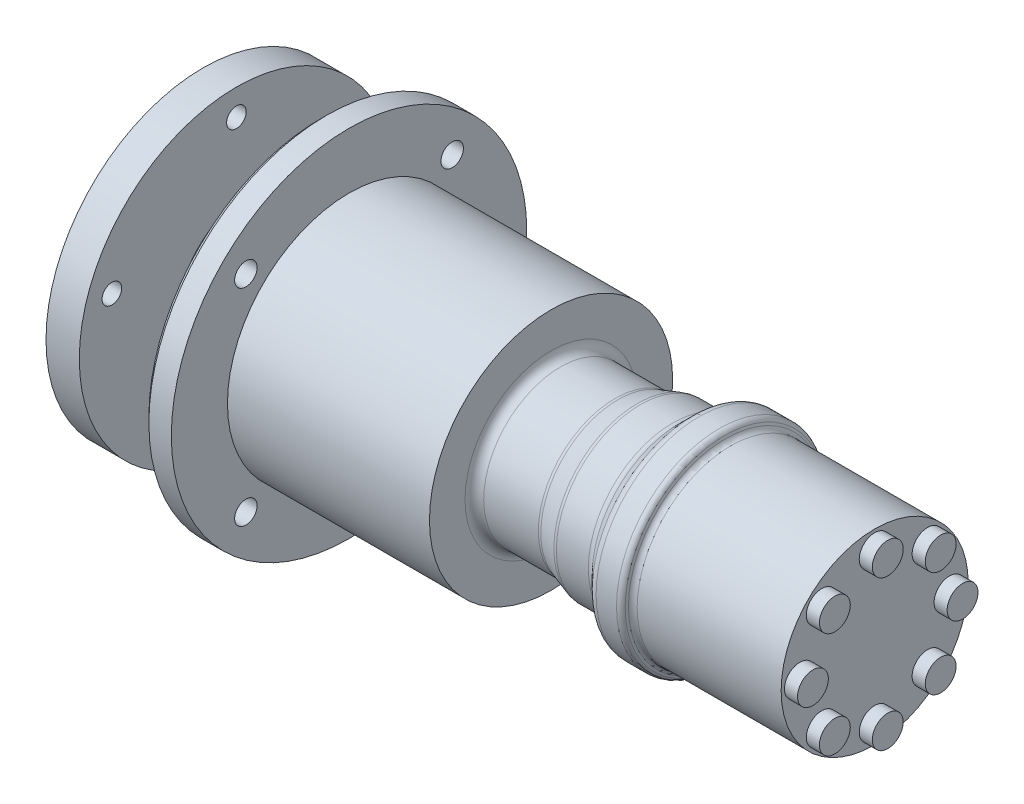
from build123d import *

# Parameters (mm, degrees)
ESQUISSE2_R                      = 8.25
EXTRUSION1_DEPTH                 = 7
R_P_TITION_CIRCULAIRE1_COUNT     = 8
ESQUISSE3_W                      = 6
ESQUISSE3_H                      = 303
TROU_TARAUD_M12X1_251_AT_2_COUNT = 2
TROU_TARAUD_M12X1_251_AT_2_PITCH = 110.3
TROU_TARAUD_M12X1_251_AT_3_COUNT = 2
TROU_TARAUD_M12X1_251_AT_3_PITCH = 155.98775593
TROU_TARAUD_M12X1_251_AT_4_COUNT = 2
TROU_TARAUD_M12X1_251_AT_4_PITCH = 110.3
ENL_V_MAT_EXTRU_1_REACH          = 391.879
ESQUISSE4_R                      = 5.25
R_P_TITION_CIRCULAIRE2_COUNT     = 5


with BuildPart() as part:
    # Esquisse1 → R_volution1 (revolve)
    with BuildSketch(Plane.XY, mode=Mode.PRIVATE) as r_volution1_sk:
        with BuildLine():
            Line((0, 0), (0, 42.5))
            Line((0, 42.5), (7, 42.5))
            Line((7, 42.5), (7, 84))
            Line((7, 84), (24.8, 84))
            Line((24.8, 84), (24.8, 27.4))
            Line((24.8, 27.4), (33, 27.4))
            Line((33, 27.4), (33, 40.1))
            Line((33, 40.1), (37, 40.1))
            Line((37, 40.1), (37, 43.9))
            Line((37, 43.9), (70, 54.9))
            Line((70, 54.9), (70, 92))
            Line((70, 92), (73, 95))
            Line((73, 95), (85, 95))
            Line((85, 95), (85, 65))
            Line((85, 65), (193, 65))
            Line((193, 65), (193, 46))
            ThreePointArc((193, 46), (194.464466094, 42.464466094), (198, 41))
            Line((198, 41), (227.188611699, 41))
            ThreePointArc((227.188611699, 41), (227.989522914, 41.064562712), (228.769750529, 41.25658351))
            Line((228.769750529, 41.25658351), (239.230249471, 44.74341649))
            ThreePointArc((239.230249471, 44.74341649), (240.010477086, 44.935437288), (240.811388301, 45))
            Line((240.811388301, 45), (257.928932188, 45))
            ThreePointArc((257.928932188, 45), (259.84234935, 45.380602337), (261.464466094, 46.464466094))
            Line((261.464466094, 46.464466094), (268.535533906, 53.535533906))
            ThreePointArc((268.535533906, 53.535533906), (270.15765065, 54.619397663), (272.071067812, 55))
            Line((272.071067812, 55), (282.968901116, 55))
            ThreePointArc((282.968901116, 55), (284.650787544, 54.484201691), (285.754331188, 53.114172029))
            Line((285.754331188, 53.114172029), (286.245668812, 51.885827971))
            ThreePointArc((286.245668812, 51.885827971), (287.349212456, 50.515798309), (289.031098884, 50))
            Line((289.031098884, 50), (366, 50))
            Line((366, 50), (366, 0))
            Line((366, 0), (0, 0))
        make_face()
    revolve(r_volution1_sk.sketch.rotate(Axis((0, 0, 0), (1, 0, 0)), 90), axis=Axis((0, 0, 0), (1, 0, 0)))

    # Esquisse2 → Extrusion1 (add)
    with BuildSketch(Plane(origin=(366, 0, 0), x_dir=(0, 0, -1), z_dir=(1, 0, 0))):
        with Locations(Location((0, 40, 0), (0, 0, 180))):
            Circle(ESQUISSE2_R)
    extrusion1 = extrude(amount=EXTRUSION1_DEPTH)

    # R_p_tition circulaire1: Extrusion1 ×8 about axis
    r_p_tition_circulaire1_axis = Axis((0, 0, 0), (1, 0, 0))
    for i in range(1, R_P_TITION_CIRCULAIRE1_COUNT):
        add(extrusion1.rotate(r_p_tition_circulaire1_axis, i * 360 / R_P_TITION_CIRCULAIRE1_COUNT))

    # Esquisse3 → Trou taraud_ M12x1.251 (revolve, cut)
    with BuildSketch(Plane(origin=(70, 55.15, 55.141342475), x_dir=(0, 0, 1), z_dir=(0, 1, 0))):
        with Locations((3, 151.5)):
            Rectangle(ESQUISSE3_W, ESQUISSE3_H)
    trou_taraud_m12x1_251 = revolve(axis=Axis((63.65, 55.15, 55.141342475), (1, 0, 0)), mode=Mode.SUBTRACT)

    # Trou taraud_ M12x1.251 at 2: Trou taraud_ M12x1.251 ×2
    with Locations(*[(0, -i * TROU_TARAUD_M12X1_251_AT_2_PITCH, 0) for i in range(1, TROU_TARAUD_M12X1_251_AT_2_COUNT)]):
        add(trou_taraud_m12x1_251, mode=Mode.SUBTRACT)

    # Trou taraud_ M12x1.251 at 3: Trou taraud_ M12x1.251 ×2
    with Locations(*[Vector(0, -0.7071067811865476, -0.7071067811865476) * (i * TROU_TARAUD_M12X1_251_AT_3_PITCH) for i in range(1, TROU_TARAUD_M12X1_251_AT_3_COUNT)]):
        add(trou_taraud_m12x1_251, mode=Mode.SUBTRACT)

    # Trou taraud_ M12x1.251 at 4: Trou taraud_ M12x1.251 ×2
    with Locations(*[(0, 0, -i * TROU_TARAUD_M12X1_251_AT_4_PITCH) for i in range(1, TROU_TARAUD_M12X1_251_AT_4_COUNT)]):
        add(trou_taraud_m12x1_251, mode=Mode.SUBTRACT)

    # Esquisse4 → Enl_v. mat.-Extru.1 (cut, up to next)
    with BuildSketch(Plane.ZY.offset(-7), mode=Mode.PRIVATE) as enl_v_mat_extru_1_sk1:
        with Locations((0, 70)):
            Circle(ESQUISSE4_R)
    enl_v_mat_extru_1_tool1 = extrude(enl_v_mat_extru_1_sk1.sketch, amount=-ENL_V_MAT_EXTRU_1_REACH, mode=Mode.PRIVATE) & part.part
    enl_v_mat_extru_1 = enl_v_mat_extru_1_tool1.solids().sort_by_distance((7, 70, 0))[0]
    add(enl_v_mat_extru_1, mode=Mode.SUBTRACT)

    # R_p_tition circulaire2: Enl_v. mat.-Extru.1 ×5 about axis
    r_p_tition_circulaire2_axis = Axis((0, 0, 0), (1, 0, 0))
    for i in range(1, R_P_TITION_CIRCULAIRE2_COUNT):
        add(enl_v_mat_extru_1.rotate(r_p_tition_circulaire2_axis, i * 360 / R_P_TITION_CIRCULAIRE2_COUNT), mode=Mode.SUBTRACT)


solid = part.part
